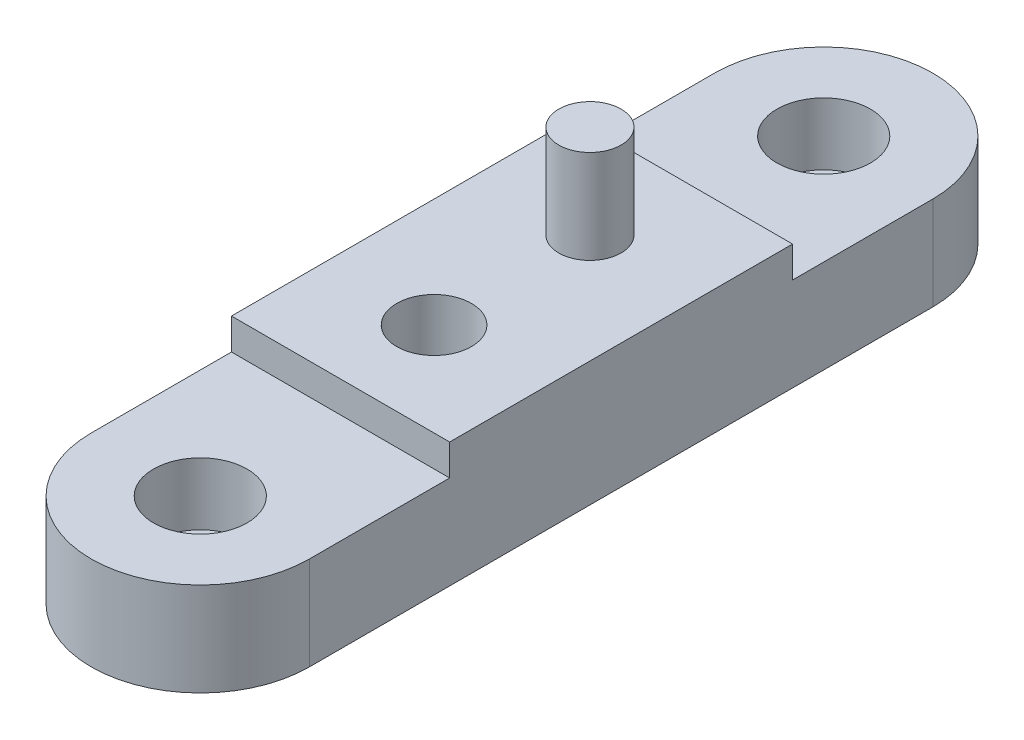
from build123d import *

# Parameters (mm, degrees)
BOSS_EXTRUDE1_DEPTH = 4
CUT_EXTRUDE1_START  = -1
CUT_EXTRUDE1_DEPTH  = 1
SKETCH3_R           = 1.5
CUT_EXTRUDE2_DEPTH  = 2
SKETCH4_R           = 1
BOSS_EXTRUDE2_DEPTH = 3
SKETCH5_R           = 1.2
CUT_EXTRUDE3_DEPTH  = 4


with BuildPart() as part:
    # Sketch1 → Boss-Extrude1 (new body)
    with BuildSketch(Plane(origin=(0, 0, 0), x_dir=(1, 0, 0), z_dir=(0, 1, 0))):
        with BuildLine():
            Line((-3.5, -10), (3.5, -10))
            Line((3.5, -10), (3.5, 0))
            ThreePointArc((3.5, 0), (0, 3.5), (-3.5, 0))
            Line((-3.5, 0), (-3.5, -10))
        make_face()
    extrude(amount=BOSS_EXTRUDE1_DEPTH)

    # Sketch2 → Cut-Extrude1 (cut)
    with BuildSketch(Plane(origin=(0, 4, 0), x_dir=(1, 0, 0), z_dir=(0, 1, 0)).offset(CUT_EXTRUDE1_START)):
        with BuildLine():
            Line((-3.5, -4.5), (3.5, -4.5))
            Line((3.5, -4.5), (3.5, 0))
            ThreePointArc((3.5, 0), (0, 3.5), (-3.5, 0))
            Line((-3.5, 0), (-3.5, -4.5))
        make_face()
    extrude(amount=CUT_EXTRUDE1_DEPTH, mode=Mode.SUBTRACT)

    # Sketch3 → Cut-Extrude2 (cut)
    with BuildSketch(Plane(origin=(0, 3, 0), x_dir=(1, 0, 0), z_dir=(0, 1, 0))):
        with Locations(Location((0, 0, 0), (0, 0, 270))):
            Circle(SKETCH3_R)
    extrude(amount=-CUT_EXTRUDE2_DEPTH, mode=Mode.SUBTRACT)

    # Mirror1: part across plane


with BuildPart() as part_1:
    add(part.part)
    add(part.part.mirror(Plane(origin=(-3.5, 4, 10), x_dir=(1, 0, 0), z_dir=(0, 0, -1))))

    # Sketch4 → Boss-Extrude2 (add)
    with BuildSketch(Plane(origin=(0, 4, 0), x_dir=(1, 0, 0), z_dir=(0, 1, 0))):
        with Locations(Location((0, -7.5, 0), (0, 0, 270))):
            Circle(SKETCH4_R)
    extrude(amount=BOSS_EXTRUDE2_DEPTH)

    # Sketch5 → Cut-Extrude3 (cut)
    with BuildSketch(Plane(origin=(0, 4, 0), x_dir=(1, 0, 0), z_dir=(0, 1, 0))):
        with Locations(Location((0, -12.5, 0), (0, 0, 270))):
            Circle(SKETCH5_R)
    extrude(amount=-CUT_EXTRUDE3_DEPTH, mode=Mode.SUBTRACT)


solid = part_1.part
